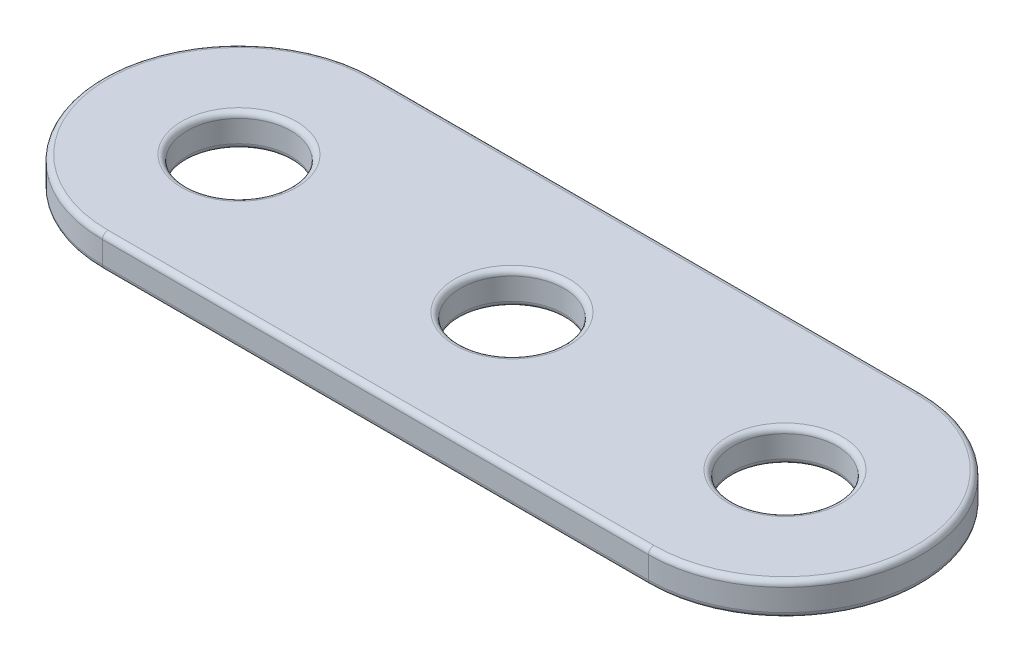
ISO-10303-21;
HEADER;
FILE_DESCRIPTION(('STEP AP214'),'2;1');
FILE_NAME('part.step','',(''),(''),'','','');
FILE_SCHEMA(('AUTOMOTIVE_DESIGN { 1 0 10303 214 1 1 1 1 }'));
ENDSEC;
DATA;
#1=APPLICATION_CONTEXT('core data for automotive mechanical design processes');
#2=APPLICATION_PROTOCOL_DEFINITION('international standard','automotive_design',2000,#1);
#3=PRODUCT_CONTEXT('',#1,'mechanical');
#4=PRODUCT('Part','Part','',(#3));
#5=PRODUCT_RELATED_PRODUCT_CATEGORY('part','',(#4));
#6=PRODUCT_DEFINITION_FORMATION('','',#4);
#7=PRODUCT_DEFINITION_CONTEXT('part definition',#1,'design');
#8=PRODUCT_DEFINITION('design','',#6,#7);
#9=PRODUCT_DEFINITION_SHAPE('','',#8);
#10=(LENGTH_UNIT() NAMED_UNIT(*) SI_UNIT(.MILLI.,.METRE.));
#11=(NAMED_UNIT(*) PLANE_ANGLE_UNIT() SI_UNIT($,.RADIAN.));
#12=(NAMED_UNIT(*) SI_UNIT($,.STERADIAN.) SOLID_ANGLE_UNIT());
#13=UNCERTAINTY_MEASURE_WITH_UNIT(LENGTH_MEASURE(1.E-05),#10,'distance_accuracy_value','');
#14=(GEOMETRIC_REPRESENTATION_CONTEXT(3) GLOBAL_UNCERTAINTY_ASSIGNED_CONTEXT((#13)) GLOBAL_UNIT_ASSIGNED_CONTEXT((#10,
#11,#12)) REPRESENTATION_CONTEXT('',''));
#15=CARTESIAN_POINT('',(0.,0.,0.));
#16=DIRECTION('',(0.,0.,1.));
#17=DIRECTION('',(1.,0.,0.));
#18=AXIS2_PLACEMENT_3D('',#15,#16,#17);
#19=CARTESIAN_POINT('',(0.,1.524,-6.35));
#20=DIRECTION('',(0.,-1.,0.));
#21=DIRECTION('',(0.,0.,-1.));
#22=AXIS2_PLACEMENT_3D('',#19,#20,#21);
#23=CYLINDRICAL_SURFACE('',#22,6.35);
#24=DIRECTION('',(0.,-1.,0.));
#25=VECTOR('',#24,1.);
#26=CARTESIAN_POINT('',(0.,1.524,-12.7));
#27=LINE('',#26,#25);
#28=CARTESIAN_POINT('',(0.,1.27,-12.7));
#29=VERTEX_POINT('',#28);
#30=CARTESIAN_POINT('',(0.,0.254000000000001,-12.7));
#31=VERTEX_POINT('',#30);
#32=EDGE_CURVE('E136',#29,#31,#27,.T.);
#33=ORIENTED_EDGE('',*,*,#32,.T.);
#34=CARTESIAN_POINT('',(0.,0.254,-6.35));
#35=DIRECTION('',(0.,1.,0.));
#36=DIRECTION('',(0.,0.,1.));
#37=AXIS2_PLACEMENT_3D('',#34,#35,#36);
#38=CIRCLE('',#37,6.35);
#39=CARTESIAN_POINT('',(0.,0.254000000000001,0.));
#40=VERTEX_POINT('',#39);
#41=EDGE_CURVE('E166',#31,#40,#38,.T.);
#42=ORIENTED_EDGE('',*,*,#41,.T.);
#43=DIRECTION('',(0.,-1.,0.));
#44=VECTOR('',#43,1.);
#45=CARTESIAN_POINT('',(0.,1.524,0.));
#46=LINE('',#45,#44);
#47=CARTESIAN_POINT('',(0.,1.27,0.));
#48=VERTEX_POINT('',#47);
#49=EDGE_CURVE('E110',#48,#40,#46,.T.);
#50=ORIENTED_EDGE('',*,*,#49,.F.);
#51=CARTESIAN_POINT('',(0.,1.27,-6.35));
#52=DIRECTION('',(0.,1.,0.));
#53=DIRECTION('',(0.,0.,1.));
#54=AXIS2_PLACEMENT_3D('',#51,#52,#53);
#55=CIRCLE('',#54,6.35);
#56=EDGE_CURVE('E164',#48,#29,#55,.F.);
#57=ORIENTED_EDGE('',*,*,#56,.T.);
#58=EDGE_LOOP('',(#33,#42,#50,#57));
#59=FACE_BOUND('',#58,.T.);
#60=ADVANCED_FACE('F26',(#59),#23,.T.);
#61=CARTESIAN_POINT('',(0.,1.524,0.));
#62=DIRECTION('',(0.,0.,-1.));
#63=DIRECTION('',(-1.,0.,0.));
#64=AXIS2_PLACEMENT_3D('',#61,#62,#63);
#65=PLANE('',#64);
#66=ORIENTED_EDGE('',*,*,#49,.T.);
#67=DIRECTION('',(1.,0.,0.));
#68=VECTOR('',#67,1.);
#69=CARTESIAN_POINT('',(0.,0.254,0.));
#70=LINE('',#69,#68);
#71=CARTESIAN_POINT('',(25.4,0.254000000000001,0.));
#72=VERTEX_POINT('',#71);
#73=EDGE_CURVE('E109',#40,#72,#70,.T.);
#74=ORIENTED_EDGE('',*,*,#73,.T.);
#75=DIRECTION('',(0.,-1.,0.));
#76=VECTOR('',#75,1.);
#77=CARTESIAN_POINT('',(25.4,1.524,0.));
#78=LINE('',#77,#76);
#79=CARTESIAN_POINT('',(25.4,1.27,0.));
#80=VERTEX_POINT('',#79);
#81=EDGE_CURVE('E92',#80,#72,#78,.T.);
#82=ORIENTED_EDGE('',*,*,#81,.F.);
#83=DIRECTION('',(1.,0.,0.));
#84=VECTOR('',#83,1.);
#85=CARTESIAN_POINT('',(0.,1.27,0.));
#86=LINE('',#85,#84);
#87=EDGE_CURVE('E106',#80,#48,#86,.F.);
#88=ORIENTED_EDGE('',*,*,#87,.T.);
#89=EDGE_LOOP('',(#66,#74,#82,#88));
#90=FACE_BOUND('',#89,.T.);
#91=ADVANCED_FACE('F105',(#90),#65,.F.);
#92=CARTESIAN_POINT('',(25.4,1.524,-6.35));
#93=DIRECTION('',(0.,-1.,0.));
#94=DIRECTION('',(0.,0.,-1.));
#95=AXIS2_PLACEMENT_3D('',#92,#93,#94);
#96=CYLINDRICAL_SURFACE('',#95,6.35);
#97=ORIENTED_EDGE('',*,*,#81,.T.);
#98=CARTESIAN_POINT('',(25.4,0.254,-6.35));
#99=DIRECTION('',(0.,1.,0.));
#100=DIRECTION('',(0.,0.,1.));
#101=AXIS2_PLACEMENT_3D('',#98,#99,#100);
#102=CIRCLE('',#101,6.35);
#103=CARTESIAN_POINT('',(25.4,0.254000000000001,-12.7));
#104=VERTEX_POINT('',#103);
#105=EDGE_CURVE('E98',#72,#104,#102,.T.);
#106=ORIENTED_EDGE('',*,*,#105,.T.);
#107=DIRECTION('',(0.,-1.,0.));
#108=VECTOR('',#107,1.);
#109=CARTESIAN_POINT('',(25.4,1.524,-12.7));
#110=LINE('',#109,#108);
#111=CARTESIAN_POINT('',(25.4,1.27,-12.7));
#112=VERTEX_POINT('',#111);
#113=EDGE_CURVE('E94',#112,#104,#110,.T.);
#114=ORIENTED_EDGE('',*,*,#113,.F.);
#115=CARTESIAN_POINT('',(25.4,1.27,-6.35));
#116=DIRECTION('',(0.,1.,0.));
#117=DIRECTION('',(0.,0.,1.));
#118=AXIS2_PLACEMENT_3D('',#115,#116,#117);
#119=CIRCLE('',#118,6.35);
#120=EDGE_CURVE('E89',#112,#80,#119,.F.);
#121=ORIENTED_EDGE('',*,*,#120,.T.);
#122=EDGE_LOOP('',(#97,#106,#114,#121));
#123=FACE_BOUND('',#122,.T.);
#124=ADVANCED_FACE('F91',(#123),#96,.T.);
#125=CARTESIAN_POINT('',(0.,1.524,-12.7));
#126=DIRECTION('',(0.,0.,1.));
#127=DIRECTION('',(1.,0.,0.));
#128=AXIS2_PLACEMENT_3D('',#125,#126,#127);
#129=PLANE('',#128);
#130=ORIENTED_EDGE('',*,*,#113,.T.);
#131=DIRECTION('',(-1.,0.,0.));
#132=VECTOR('',#131,1.);
#133=CARTESIAN_POINT('',(0.,0.254,-12.7));
#134=LINE('',#133,#132);
#135=EDGE_CURVE('E162',#104,#31,#134,.T.);
#136=ORIENTED_EDGE('',*,*,#135,.T.);
#137=ORIENTED_EDGE('',*,*,#32,.F.);
#138=DIRECTION('',(-1.,0.,0.));
#139=VECTOR('',#138,1.);
#140=CARTESIAN_POINT('',(25.4,1.27,-12.7));
#141=LINE('',#140,#139);
#142=EDGE_CURVE('E160',#29,#112,#141,.F.);
#143=ORIENTED_EDGE('',*,*,#142,.T.);
#144=EDGE_LOOP('',(#130,#136,#137,#143));
#145=FACE_BOUND('',#144,.T.);
#146=ADVANCED_FACE('F210',(#145),#129,.F.);
#147=CARTESIAN_POINT('',(0.,1.524,-6.35));
#148=DIRECTION('',(0.,1.,0.));
#149=DIRECTION('',(0.,0.,1.));
#150=AXIS2_PLACEMENT_3D('',#147,#148,#149);
#151=PLANE('',#150);
#152=CARTESIAN_POINT('',(25.4,1.524,-6.35));
#153=DIRECTION('',(0.,1.,0.));
#154=DIRECTION('',(0.,0.,1.));
#155=AXIS2_PLACEMENT_3D('',#152,#153,#154);
#156=CIRCLE('',#155,6.096);
#157=CARTESIAN_POINT('',(25.4,1.524,-0.254));
#158=VERTEX_POINT('',#157);
#159=CARTESIAN_POINT('',(25.4,1.524,-12.446));
#160=VERTEX_POINT('',#159);
#161=EDGE_CURVE('E33',#158,#160,#156,.T.);
#162=ORIENTED_EDGE('',*,*,#161,.T.);
#163=DIRECTION('',(-1.,0.,0.));
#164=VECTOR('',#163,1.);
#165=CARTESIAN_POINT('',(0.,1.524,-12.446));
#166=LINE('',#165,#164);
#167=CARTESIAN_POINT('',(0.,1.524,-12.446));
#168=VERTEX_POINT('',#167);
#169=EDGE_CURVE('E11',#160,#168,#166,.T.);
#170=ORIENTED_EDGE('',*,*,#169,.T.);
#171=CARTESIAN_POINT('',(0.,1.524,-6.35));
#172=DIRECTION('',(0.,1.,0.));
#173=DIRECTION('',(0.,0.,1.));
#174=AXIS2_PLACEMENT_3D('',#171,#172,#173);
#175=CIRCLE('',#174,6.096);
#176=CARTESIAN_POINT('',(0.,1.524,-0.254));
#177=VERTEX_POINT('',#176);
#178=EDGE_CURVE('E195',#168,#177,#175,.T.);
#179=ORIENTED_EDGE('',*,*,#178,.T.);
#180=DIRECTION('',(1.,0.,0.));
#181=VECTOR('',#180,1.);
#182=CARTESIAN_POINT('',(25.4,1.524,-0.254));
#183=LINE('',#182,#181);
#184=EDGE_CURVE('E43',#177,#158,#183,.T.);
#185=ORIENTED_EDGE('',*,*,#184,.T.);
#186=EDGE_LOOP('',(#162,#170,#179,#185));
#187=FACE_BOUND('',#186,.T.);
#188=CARTESIAN_POINT('',(0.,1.524,-6.35));
#189=DIRECTION('',(0.,1.,0.));
#190=DIRECTION('',(0.,0.,1.));
#191=AXIS2_PLACEMENT_3D('',#188,#189,#190);
#192=CIRCLE('',#191,2.667);
#193=CARTESIAN_POINT('',(0.,1.524,-3.683));
#194=VERTEX_POINT('',#193);
#195=EDGE_CURVE('E192',#194,#194,#192,.F.);
#196=ORIENTED_EDGE('',*,*,#195,.T.);
#197=EDGE_LOOP('',(#196));
#198=FACE_BOUND('',#197,.T.);
#199=CARTESIAN_POINT('',(12.7,1.524,-6.35));
#200=DIRECTION('',(0.,1.,0.));
#201=DIRECTION('',(0.,0.,1.));
#202=AXIS2_PLACEMENT_3D('',#199,#200,#201);
#203=CIRCLE('',#202,2.667);
#204=CARTESIAN_POINT('',(12.7,1.524,-3.683));
#205=VERTEX_POINT('',#204);
#206=EDGE_CURVE('E189',#205,#205,#203,.F.);
#207=ORIENTED_EDGE('',*,*,#206,.T.);
#208=EDGE_LOOP('',(#207));
#209=FACE_BOUND('',#208,.T.);
#210=CARTESIAN_POINT('',(25.4,1.524,-6.35));
#211=DIRECTION('',(0.,1.,0.));
#212=DIRECTION('',(0.,0.,1.));
#213=AXIS2_PLACEMENT_3D('',#210,#211,#212);
#214=CIRCLE('',#213,2.667);
#215=CARTESIAN_POINT('',(25.4,1.524,-3.683));
#216=VERTEX_POINT('',#215);
#217=EDGE_CURVE('E186',#216,#216,#214,.F.);
#218=ORIENTED_EDGE('',*,*,#217,.T.);
#219=EDGE_LOOP('',(#218));
#220=FACE_BOUND('',#219,.T.);
#221=ADVANCED_FACE('F198',(#187,#198,#209,#220),#151,.T.);
#222=CARTESIAN_POINT('',(0.,0.,-6.35));
#223=DIRECTION('',(0.,1.,0.));
#224=DIRECTION('',(0.,0.,1.));
#225=AXIS2_PLACEMENT_3D('',#222,#223,#224);
#226=PLANE('',#225);
#227=CARTESIAN_POINT('',(25.4,0.,-6.35));
#228=DIRECTION('',(0.,1.,0.));
#229=DIRECTION('',(0.,0.,1.));
#230=AXIS2_PLACEMENT_3D('',#227,#228,#229);
#231=CIRCLE('',#230,6.096);
#232=CARTESIAN_POINT('',(25.4,0.,-12.446));
#233=VERTEX_POINT('',#232);
#234=CARTESIAN_POINT('',(25.4,0.,-0.254));
#235=VERTEX_POINT('',#234);
#236=EDGE_CURVE('E155',#233,#235,#231,.F.);
#237=ORIENTED_EDGE('',*,*,#236,.T.);
#238=DIRECTION('',(1.,0.,0.));
#239=VECTOR('',#238,1.);
#240=CARTESIAN_POINT('',(0.,0.,-0.254));
#241=LINE('',#240,#239);
#242=CARTESIAN_POINT('',(0.,0.,-0.254));
#243=VERTEX_POINT('',#242);
#244=EDGE_CURVE('E99',#235,#243,#241,.F.);
#245=ORIENTED_EDGE('',*,*,#244,.T.);
#246=CARTESIAN_POINT('',(0.,0.,-6.35));
#247=DIRECTION('',(0.,1.,0.));
#248=DIRECTION('',(0.,0.,1.));
#249=AXIS2_PLACEMENT_3D('',#246,#247,#248);
#250=CIRCLE('',#249,6.096);
#251=CARTESIAN_POINT('',(0.,0.,-12.446));
#252=VERTEX_POINT('',#251);
#253=EDGE_CURVE('E151',#243,#252,#250,.F.);
#254=ORIENTED_EDGE('',*,*,#253,.T.);
#255=DIRECTION('',(-1.,0.,0.));
#256=VECTOR('',#255,1.);
#257=CARTESIAN_POINT('',(0.,0.,-12.446));
#258=LINE('',#257,#256);
#259=EDGE_CURVE('E153',#252,#233,#258,.F.);
#260=ORIENTED_EDGE('',*,*,#259,.T.);
#261=EDGE_LOOP('',(#237,#245,#254,#260));
#262=FACE_BOUND('',#261,.T.);
#263=CARTESIAN_POINT('',(0.,0.,-6.35));
#264=DIRECTION('',(0.,1.,0.));
#265=DIRECTION('',(0.,0.,1.));
#266=AXIS2_PLACEMENT_3D('',#263,#264,#265);
#267=CIRCLE('',#266,2.667);
#268=CARTESIAN_POINT('',(0.,0.,-3.683));
#269=VERTEX_POINT('',#268);
#270=EDGE_CURVE('E148',#269,#269,#267,.T.);
#271=ORIENTED_EDGE('',*,*,#270,.T.);
#272=EDGE_LOOP('',(#271));
#273=FACE_BOUND('',#272,.T.);
#274=CARTESIAN_POINT('',(12.7,0.,-6.35));
#275=DIRECTION('',(0.,1.,0.));
#276=DIRECTION('',(0.,0.,1.));
#277=AXIS2_PLACEMENT_3D('',#274,#275,#276);
#278=CIRCLE('',#277,2.667);
#279=CARTESIAN_POINT('',(12.7,0.,-3.683));
#280=VERTEX_POINT('',#279);
#281=EDGE_CURVE('E145',#280,#280,#278,.T.);
#282=ORIENTED_EDGE('',*,*,#281,.T.);
#283=EDGE_LOOP('',(#282));
#284=FACE_BOUND('',#283,.T.);
#285=CARTESIAN_POINT('',(25.4,0.,-6.35));
#286=DIRECTION('',(0.,1.,0.));
#287=DIRECTION('',(0.,0.,1.));
#288=AXIS2_PLACEMENT_3D('',#285,#286,#287);
#289=CIRCLE('',#288,2.667);
#290=CARTESIAN_POINT('',(25.4,0.,-3.683));
#291=VERTEX_POINT('',#290);
#292=EDGE_CURVE('E142',#291,#291,#289,.T.);
#293=ORIENTED_EDGE('',*,*,#292,.T.);
#294=EDGE_LOOP('',(#293));
#295=FACE_BOUND('',#294,.T.);
#296=ADVANCED_FACE('F239',(#262,#273,#284,#295),#226,.F.);
#297=CARTESIAN_POINT('',(0.,0.,-6.35));
#298=DIRECTION('',(0.,1.,0.));
#299=DIRECTION('',(0.,0.,1.));
#300=AXIS2_PLACEMENT_3D('',#297,#298,#299);
#301=CYLINDRICAL_SURFACE('',#300,2.413);
#302=CARTESIAN_POINT('',(0.,0.254,-6.35));
#303=DIRECTION('',(0.,1.,0.));
#304=DIRECTION('',(0.,0.,1.));
#305=AXIS2_PLACEMENT_3D('',#302,#303,#304);
#306=CIRCLE('',#305,2.413);
#307=CARTESIAN_POINT('',(0.,0.254,-3.937));
#308=VERTEX_POINT('',#307);
#309=EDGE_CURVE('E171',#308,#308,#306,.F.);
#310=CARTESIAN_POINT('',(0.,1.27,-6.35));
#311=DIRECTION('',(0.,1.,0.));
#312=DIRECTION('',(0.,0.,1.));
#313=AXIS2_PLACEMENT_3D('',#310,#311,#312);
#314=CIRCLE('',#313,2.413);
#315=CARTESIAN_POINT('',(0.,1.27,-3.937));
#316=VERTEX_POINT('',#315);
#317=EDGE_CURVE('E168',#316,#316,#314,.T.);
#318=CARTESIAN_POINT('',(0.,0.254,-3.937));
#319=CARTESIAN_POINT('',(0.,0.264583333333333,-3.937));
#320=CARTESIAN_POINT('',(0.,0.275166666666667,-3.937));
#321=CARTESIAN_POINT('',(0.,0.296333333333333,-3.937));
#322=CARTESIAN_POINT('',(0.,0.306916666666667,-3.937));
#323=CARTESIAN_POINT('',(0.,0.328083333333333,-3.937));
#324=CARTESIAN_POINT('',(0.,0.338666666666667,-3.937));
#325=CARTESIAN_POINT('',(0.,0.359833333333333,-3.937));
#326=CARTESIAN_POINT('',(0.,0.370416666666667,-3.937));
#327=CARTESIAN_POINT('',(0.,0.391583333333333,-3.937));
#328=CARTESIAN_POINT('',(0.,0.402166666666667,-3.937));
#329=CARTESIAN_POINT('',(0.,0.423333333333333,-3.937));
#330=CARTESIAN_POINT('',(0.,0.433916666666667,-3.937));
#331=CARTESIAN_POINT('',(0.,0.455083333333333,-3.937));
#332=CARTESIAN_POINT('',(0.,0.465666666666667,-3.937));
#333=CARTESIAN_POINT('',(0.,0.486833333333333,-3.937));
#334=CARTESIAN_POINT('',(0.,0.497416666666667,-3.937));
#335=CARTESIAN_POINT('',(0.,0.518583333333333,-3.937));
#336=CARTESIAN_POINT('',(0.,0.529166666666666,-3.937));
#337=CARTESIAN_POINT('',(0.,0.550333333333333,-3.937));
#338=CARTESIAN_POINT('',(0.,0.560916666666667,-3.937));
#339=CARTESIAN_POINT('',(0.,0.582083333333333,-3.937));
#340=CARTESIAN_POINT('',(0.,0.592666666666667,-3.937));
#341=CARTESIAN_POINT('',(0.,0.613833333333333,-3.937));
#342=CARTESIAN_POINT('',(0.,0.624416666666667,-3.937));
#343=CARTESIAN_POINT('',(0.,0.645583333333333,-3.937));
#344=CARTESIAN_POINT('',(0.,0.656166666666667,-3.937));
#345=CARTESIAN_POINT('',(0.,0.677333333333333,-3.937));
#346=CARTESIAN_POINT('',(0.,0.687916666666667,-3.937));
#347=CARTESIAN_POINT('',(0.,0.709083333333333,-3.937));
#348=CARTESIAN_POINT('',(0.,0.719666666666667,-3.937));
#349=CARTESIAN_POINT('',(0.,0.740833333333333,-3.937));
#350=CARTESIAN_POINT('',(0.,0.751416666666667,-3.937));
#351=CARTESIAN_POINT('',(0.,0.772583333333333,-3.937));
#352=CARTESIAN_POINT('',(0.,0.783166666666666,-3.937));
#353=CARTESIAN_POINT('',(0.,0.804333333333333,-3.937));
#354=CARTESIAN_POINT('',(0.,0.814916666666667,-3.937));
#355=CARTESIAN_POINT('',(0.,0.836083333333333,-3.937));
#356=CARTESIAN_POINT('',(0.,0.846666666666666,-3.937));
#357=CARTESIAN_POINT('',(0.,0.867833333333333,-3.937));
#358=CARTESIAN_POINT('',(0.,0.878416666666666,-3.937));
#359=CARTESIAN_POINT('',(0.,0.899583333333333,-3.937));
#360=CARTESIAN_POINT('',(0.,0.910166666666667,-3.937));
#361=CARTESIAN_POINT('',(0.,0.931333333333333,-3.937));
#362=CARTESIAN_POINT('',(0.,0.941916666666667,-3.937));
#363=CARTESIAN_POINT('',(0.,0.963083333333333,-3.937));
#364=CARTESIAN_POINT('',(0.,0.973666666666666,-3.937));
#365=CARTESIAN_POINT('',(0.,0.994833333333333,-3.937));
#366=CARTESIAN_POINT('',(0.,1.00541666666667,-3.937));
#367=CARTESIAN_POINT('',(0.,1.02658333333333,-3.937));
#368=CARTESIAN_POINT('',(0.,1.03716666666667,-3.937));
#369=CARTESIAN_POINT('',(0.,1.05833333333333,-3.937));
#370=CARTESIAN_POINT('',(0.,1.06891666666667,-3.937));
#371=CARTESIAN_POINT('',(0.,1.09008333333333,-3.937));
#372=CARTESIAN_POINT('',(0.,1.10066666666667,-3.937));
#373=CARTESIAN_POINT('',(0.,1.12183333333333,-3.937));
#374=CARTESIAN_POINT('',(0.,1.13241666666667,-3.937));
#375=CARTESIAN_POINT('',(0.,1.15358333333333,-3.937));
#376=CARTESIAN_POINT('',(0.,1.16416666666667,-3.937));
#377=CARTESIAN_POINT('',(0.,1.18533333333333,-3.937));
#378=CARTESIAN_POINT('',(0.,1.19591666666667,-3.937));
#379=CARTESIAN_POINT('',(0.,1.21708333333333,-3.937));
#380=CARTESIAN_POINT('',(0.,1.22766666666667,-3.937));
#381=CARTESIAN_POINT('',(0.,1.24883333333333,-3.937));
#382=CARTESIAN_POINT('',(0.,1.25941666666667,-3.937));
#383=CARTESIAN_POINT('',(0.,1.27,-3.937));
#384=B_SPLINE_CURVE_WITH_KNOTS('',3,(#318,#319,#320,#321,#322,#323,#324,#325,#326,#327,#328,
#329,#330,#331,#332,#333,#334,#335,#336,#337,#338,#339,#340,#341,#342,#343,#344,#345,#346,#347,
#348,#349,#350,#351,#352,#353,#354,#355,#356,#357,#358,#359,#360,#361,#362,#363,#364,#365,#366,
#367,#368,#369,#370,#371,#372,#373,#374,#375,#376,#377,#378,#379,#380,#381,#382,#383),
.UNSPECIFIED.,.F.,.F.,(4,2,2,2,2,2,2,2,2,2,2,2,2,2,2,2,2,2,2,2,2,2,2,2,2,2,2,2,2,2,2,2,4),(0.,
0.03175,0.0635,0.09525,0.127,0.15875,0.1905,0.22225,0.254,0.28575,0.3175,0.34925,0.381,0.41275,
0.4445,0.47625,0.508,0.53975,0.5715,0.60325,0.635,0.66675,0.6985,0.73025,0.762,0.79375,0.8255,
0.85725,0.889,0.92075,0.9525,0.98425,1.016),.UNSPECIFIED.);
#385=EDGE_CURVE('BSEAM242',#308,#316,#384,.T.);
#386=ORIENTED_EDGE('',*,*,#309,.T.);
#387=ORIENTED_EDGE('',*,*,#317,.T.);
#388=ORIENTED_EDGE('',*,*,#385,.T.);
#389=ORIENTED_EDGE('',*,*,#385,.F.);
#390=EDGE_LOOP('',(#386,#388,#387,#389));
#391=FACE_BOUND('',#390,.T.);
#392=ADVANCED_FACE('F242',(#391),#301,.F.);
#393=CARTESIAN_POINT('',(12.7,0.,-6.35));
#394=DIRECTION('',(0.,1.,0.));
#395=DIRECTION('',(0.,0.,1.));
#396=AXIS2_PLACEMENT_3D('',#393,#394,#395);
#397=CYLINDRICAL_SURFACE('',#396,2.413);
#398=CARTESIAN_POINT('',(12.7,0.254,-6.35));
#399=DIRECTION('',(0.,1.,0.));
#400=DIRECTION('',(0.,0.,1.));
#401=AXIS2_PLACEMENT_3D('',#398,#399,#400);
#402=CIRCLE('',#401,2.413);
#403=CARTESIAN_POINT('',(12.7,0.254,-3.937));
#404=VERTEX_POINT('',#403);
#405=EDGE_CURVE('E177',#404,#404,#402,.F.);
#406=CARTESIAN_POINT('',(12.7,1.27,-6.35));
#407=DIRECTION('',(0.,1.,0.));
#408=DIRECTION('',(0.,0.,1.));
#409=AXIS2_PLACEMENT_3D('',#406,#407,#408);
#410=CIRCLE('',#409,2.413);
#411=CARTESIAN_POINT('',(12.7,1.27,-3.937));
#412=VERTEX_POINT('',#411);
#413=EDGE_CURVE('E174',#412,#412,#410,.T.);
#414=CARTESIAN_POINT('',(12.7,0.254,-3.937));
#415=CARTESIAN_POINT('',(12.7,0.264583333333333,-3.937));
#416=CARTESIAN_POINT('',(12.7,0.275166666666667,-3.937));
#417=CARTESIAN_POINT('',(12.7,0.296333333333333,-3.937));
#418=CARTESIAN_POINT('',(12.7,0.306916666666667,-3.937));
#419=CARTESIAN_POINT('',(12.7,0.328083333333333,-3.937));
#420=CARTESIAN_POINT('',(12.7,0.338666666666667,-3.937));
#421=CARTESIAN_POINT('',(12.7,0.359833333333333,-3.937));
#422=CARTESIAN_POINT('',(12.7,0.370416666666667,-3.937));
#423=CARTESIAN_POINT('',(12.7,0.391583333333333,-3.937));
#424=CARTESIAN_POINT('',(12.7,0.402166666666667,-3.937));
#425=CARTESIAN_POINT('',(12.7,0.423333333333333,-3.937));
#426=CARTESIAN_POINT('',(12.7,0.433916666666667,-3.937));
#427=CARTESIAN_POINT('',(12.7,0.455083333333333,-3.937));
#428=CARTESIAN_POINT('',(12.7,0.465666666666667,-3.937));
#429=CARTESIAN_POINT('',(12.7,0.486833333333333,-3.937));
#430=CARTESIAN_POINT('',(12.7,0.497416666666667,-3.937));
#431=CARTESIAN_POINT('',(12.7,0.518583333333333,-3.937));
#432=CARTESIAN_POINT('',(12.7,0.529166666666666,-3.937));
#433=CARTESIAN_POINT('',(12.7,0.550333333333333,-3.937));
#434=CARTESIAN_POINT('',(12.7,0.560916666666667,-3.937));
#435=CARTESIAN_POINT('',(12.7,0.582083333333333,-3.937));
#436=CARTESIAN_POINT('',(12.7,0.592666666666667,-3.937));
#437=CARTESIAN_POINT('',(12.7,0.613833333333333,-3.937));
#438=CARTESIAN_POINT('',(12.7,0.624416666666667,-3.937));
#439=CARTESIAN_POINT('',(12.7,0.645583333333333,-3.937));
#440=CARTESIAN_POINT('',(12.7,0.656166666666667,-3.937));
#441=CARTESIAN_POINT('',(12.7,0.677333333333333,-3.937));
#442=CARTESIAN_POINT('',(12.7,0.687916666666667,-3.937));
#443=CARTESIAN_POINT('',(12.7,0.709083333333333,-3.937));
#444=CARTESIAN_POINT('',(12.7,0.719666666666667,-3.937));
#445=CARTESIAN_POINT('',(12.7,0.740833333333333,-3.937));
#446=CARTESIAN_POINT('',(12.7,0.751416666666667,-3.937));
#447=CARTESIAN_POINT('',(12.7,0.772583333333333,-3.937));
#448=CARTESIAN_POINT('',(12.7,0.783166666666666,-3.937));
#449=CARTESIAN_POINT('',(12.7,0.804333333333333,-3.937));
#450=CARTESIAN_POINT('',(12.7,0.814916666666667,-3.937));
#451=CARTESIAN_POINT('',(12.7,0.836083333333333,-3.937));
#452=CARTESIAN_POINT('',(12.7,0.846666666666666,-3.937));
#453=CARTESIAN_POINT('',(12.7,0.867833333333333,-3.937));
#454=CARTESIAN_POINT('',(12.7,0.878416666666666,-3.937));
#455=CARTESIAN_POINT('',(12.7,0.899583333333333,-3.937));
#456=CARTESIAN_POINT('',(12.7,0.910166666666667,-3.937));
#457=CARTESIAN_POINT('',(12.7,0.931333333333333,-3.937));
#458=CARTESIAN_POINT('',(12.7,0.941916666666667,-3.937));
#459=CARTESIAN_POINT('',(12.7,0.963083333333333,-3.937));
#460=CARTESIAN_POINT('',(12.7,0.973666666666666,-3.937));
#461=CARTESIAN_POINT('',(12.7,0.994833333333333,-3.937));
#462=CARTESIAN_POINT('',(12.7,1.00541666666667,-3.937));
#463=CARTESIAN_POINT('',(12.7,1.02658333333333,-3.937));
#464=CARTESIAN_POINT('',(12.7,1.03716666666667,-3.937));
#465=CARTESIAN_POINT('',(12.7,1.05833333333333,-3.937));
#466=CARTESIAN_POINT('',(12.7,1.06891666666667,-3.937));
#467=CARTESIAN_POINT('',(12.7,1.09008333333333,-3.937));
#468=CARTESIAN_POINT('',(12.7,1.10066666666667,-3.937));
#469=CARTESIAN_POINT('',(12.7,1.12183333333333,-3.937));
#470=CARTESIAN_POINT('',(12.7,1.13241666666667,-3.937));
#471=CARTESIAN_POINT('',(12.7,1.15358333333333,-3.937));
#472=CARTESIAN_POINT('',(12.7,1.16416666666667,-3.937));
#473=CARTESIAN_POINT('',(12.7,1.18533333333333,-3.937));
#474=CARTESIAN_POINT('',(12.7,1.19591666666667,-3.937));
#475=CARTESIAN_POINT('',(12.7,1.21708333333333,-3.937));
#476=CARTESIAN_POINT('',(12.7,1.22766666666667,-3.937));
#477=CARTESIAN_POINT('',(12.7,1.24883333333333,-3.937));
#478=CARTESIAN_POINT('',(12.7,1.25941666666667,-3.937));
#479=CARTESIAN_POINT('',(12.7,1.27,-3.937));
#480=B_SPLINE_CURVE_WITH_KNOTS('',3,(#414,#415,#416,#417,#418,#419,#420,#421,#422,#423,#424,
#425,#426,#427,#428,#429,#430,#431,#432,#433,#434,#435,#436,#437,#438,#439,#440,#441,#442,#443,
#444,#445,#446,#447,#448,#449,#450,#451,#452,#453,#454,#455,#456,#457,#458,#459,#460,#461,#462,
#463,#464,#465,#466,#467,#468,#469,#470,#471,#472,#473,#474,#475,#476,#477,#478,#479),
.UNSPECIFIED.,.F.,.F.,(4,2,2,2,2,2,2,2,2,2,2,2,2,2,2,2,2,2,2,2,2,2,2,2,2,2,2,2,2,2,2,2,4),(0.,
0.03175,0.0635,0.09525,0.127,0.15875,0.1905,0.22225,0.254,0.28575,0.3175,0.34925,0.381,0.41275,
0.4445,0.47625,0.508,0.53975,0.5715,0.60325,0.635,0.66675,0.6985,0.73025,0.762,0.79375,0.8255,
0.85725,0.889,0.92075,0.9525,0.98425,1.016),.UNSPECIFIED.);
#481=EDGE_CURVE('BSEAM246',#404,#412,#480,.T.);
#482=ORIENTED_EDGE('',*,*,#405,.T.);
#483=ORIENTED_EDGE('',*,*,#413,.T.);
#484=ORIENTED_EDGE('',*,*,#481,.T.);
#485=ORIENTED_EDGE('',*,*,#481,.F.);
#486=EDGE_LOOP('',(#482,#484,#483,#485));
#487=FACE_BOUND('',#486,.T.);
#488=ADVANCED_FACE('F246',(#487),#397,.F.);
#489=CARTESIAN_POINT('',(25.4,0.,-6.35));
#490=DIRECTION('',(0.,1.,0.));
#491=DIRECTION('',(0.,0.,1.));
#492=AXIS2_PLACEMENT_3D('',#489,#490,#491);
#493=CYLINDRICAL_SURFACE('',#492,2.413);
#494=CARTESIAN_POINT('',(25.4,0.254,-6.35));
#495=DIRECTION('',(0.,1.,0.));
#496=DIRECTION('',(0.,0.,1.));
#497=AXIS2_PLACEMENT_3D('',#494,#495,#496);
#498=CIRCLE('',#497,2.413);
#499=CARTESIAN_POINT('',(25.4,0.254,-3.937));
#500=VERTEX_POINT('',#499);
#501=EDGE_CURVE('E183',#500,#500,#498,.F.);
#502=CARTESIAN_POINT('',(25.4,1.27,-6.35));
#503=DIRECTION('',(0.,1.,0.));
#504=DIRECTION('',(0.,0.,1.));
#505=AXIS2_PLACEMENT_3D('',#502,#503,#504);
#506=CIRCLE('',#505,2.413);
#507=CARTESIAN_POINT('',(25.4,1.27,-3.937));
#508=VERTEX_POINT('',#507);
#509=EDGE_CURVE('E180',#508,#508,#506,.T.);
#510=CARTESIAN_POINT('',(25.4,0.254,-3.937));
#511=CARTESIAN_POINT('',(25.4,0.264583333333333,-3.937));
#512=CARTESIAN_POINT('',(25.4,0.275166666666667,-3.937));
#513=CARTESIAN_POINT('',(25.4,0.296333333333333,-3.937));
#514=CARTESIAN_POINT('',(25.4,0.306916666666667,-3.937));
#515=CARTESIAN_POINT('',(25.4,0.328083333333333,-3.937));
#516=CARTESIAN_POINT('',(25.4,0.338666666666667,-3.937));
#517=CARTESIAN_POINT('',(25.4,0.359833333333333,-3.937));
#518=CARTESIAN_POINT('',(25.4,0.370416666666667,-3.937));
#519=CARTESIAN_POINT('',(25.4,0.391583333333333,-3.937));
#520=CARTESIAN_POINT('',(25.4,0.402166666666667,-3.937));
#521=CARTESIAN_POINT('',(25.4,0.423333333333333,-3.937));
#522=CARTESIAN_POINT('',(25.4,0.433916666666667,-3.937));
#523=CARTESIAN_POINT('',(25.4,0.455083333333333,-3.937));
#524=CARTESIAN_POINT('',(25.4,0.465666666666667,-3.937));
#525=CARTESIAN_POINT('',(25.4,0.486833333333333,-3.937));
#526=CARTESIAN_POINT('',(25.4,0.497416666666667,-3.937));
#527=CARTESIAN_POINT('',(25.4,0.518583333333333,-3.937));
#528=CARTESIAN_POINT('',(25.4,0.529166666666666,-3.937));
#529=CARTESIAN_POINT('',(25.4,0.550333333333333,-3.937));
#530=CARTESIAN_POINT('',(25.4,0.560916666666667,-3.937));
#531=CARTESIAN_POINT('',(25.4,0.582083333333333,-3.937));
#532=CARTESIAN_POINT('',(25.4,0.592666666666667,-3.937));
#533=CARTESIAN_POINT('',(25.4,0.613833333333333,-3.937));
#534=CARTESIAN_POINT('',(25.4,0.624416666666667,-3.937));
#535=CARTESIAN_POINT('',(25.4,0.645583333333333,-3.937));
#536=CARTESIAN_POINT('',(25.4,0.656166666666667,-3.937));
#537=CARTESIAN_POINT('',(25.4,0.677333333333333,-3.937));
#538=CARTESIAN_POINT('',(25.4,0.687916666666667,-3.937));
#539=CARTESIAN_POINT('',(25.4,0.709083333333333,-3.937));
#540=CARTESIAN_POINT('',(25.4,0.719666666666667,-3.937));
#541=CARTESIAN_POINT('',(25.4,0.740833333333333,-3.937));
#542=CARTESIAN_POINT('',(25.4,0.751416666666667,-3.937));
#543=CARTESIAN_POINT('',(25.4,0.772583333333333,-3.937));
#544=CARTESIAN_POINT('',(25.4,0.783166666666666,-3.937));
#545=CARTESIAN_POINT('',(25.4,0.804333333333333,-3.937));
#546=CARTESIAN_POINT('',(25.4,0.814916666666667,-3.937));
#547=CARTESIAN_POINT('',(25.4,0.836083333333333,-3.937));
#548=CARTESIAN_POINT('',(25.4,0.846666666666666,-3.937));
#549=CARTESIAN_POINT('',(25.4,0.867833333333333,-3.937));
#550=CARTESIAN_POINT('',(25.4,0.878416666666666,-3.937));
#551=CARTESIAN_POINT('',(25.4,0.899583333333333,-3.937));
#552=CARTESIAN_POINT('',(25.4,0.910166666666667,-3.937));
#553=CARTESIAN_POINT('',(25.4,0.931333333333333,-3.937));
#554=CARTESIAN_POINT('',(25.4,0.941916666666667,-3.937));
#555=CARTESIAN_POINT('',(25.4,0.963083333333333,-3.937));
#556=CARTESIAN_POINT('',(25.4,0.973666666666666,-3.937));
#557=CARTESIAN_POINT('',(25.4,0.994833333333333,-3.937));
#558=CARTESIAN_POINT('',(25.4,1.00541666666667,-3.937));
#559=CARTESIAN_POINT('',(25.4,1.02658333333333,-3.937));
#560=CARTESIAN_POINT('',(25.4,1.03716666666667,-3.937));
#561=CARTESIAN_POINT('',(25.4,1.05833333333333,-3.937));
#562=CARTESIAN_POINT('',(25.4,1.06891666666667,-3.937));
#563=CARTESIAN_POINT('',(25.4,1.09008333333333,-3.937));
#564=CARTESIAN_POINT('',(25.4,1.10066666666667,-3.937));
#565=CARTESIAN_POINT('',(25.4,1.12183333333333,-3.937));
#566=CARTESIAN_POINT('',(25.4,1.13241666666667,-3.937));
#567=CARTESIAN_POINT('',(25.4,1.15358333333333,-3.937));
#568=CARTESIAN_POINT('',(25.4,1.16416666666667,-3.937));
#569=CARTESIAN_POINT('',(25.4,1.18533333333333,-3.937));
#570=CARTESIAN_POINT('',(25.4,1.19591666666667,-3.937));
#571=CARTESIAN_POINT('',(25.4,1.21708333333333,-3.937));
#572=CARTESIAN_POINT('',(25.4,1.22766666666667,-3.937));
#573=CARTESIAN_POINT('',(25.4,1.24883333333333,-3.937));
#574=CARTESIAN_POINT('',(25.4,1.25941666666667,-3.937));
#575=CARTESIAN_POINT('',(25.4,1.27,-3.937));
#576=B_SPLINE_CURVE_WITH_KNOTS('',3,(#510,#511,#512,#513,#514,#515,#516,#517,#518,#519,#520,
#521,#522,#523,#524,#525,#526,#527,#528,#529,#530,#531,#532,#533,#534,#535,#536,#537,#538,#539,
#540,#541,#542,#543,#544,#545,#546,#547,#548,#549,#550,#551,#552,#553,#554,#555,#556,#557,#558,
#559,#560,#561,#562,#563,#564,#565,#566,#567,#568,#569,#570,#571,#572,#573,#574,#575),
.UNSPECIFIED.,.F.,.F.,(4,2,2,2,2,2,2,2,2,2,2,2,2,2,2,2,2,2,2,2,2,2,2,2,2,2,2,2,2,2,2,2,4),(0.,
0.03175,0.0635,0.09525,0.127,0.15875,0.1905,0.22225,0.254,0.28575,0.3175,0.34925,0.381,0.41275,
0.4445,0.47625,0.508,0.53975,0.5715,0.60325,0.635,0.66675,0.6985,0.73025,0.762,0.79375,0.8255,
0.85725,0.889,0.92075,0.9525,0.98425,1.016),.UNSPECIFIED.);
#577=EDGE_CURVE('BSEAM250',#500,#508,#576,.T.);
#578=ORIENTED_EDGE('',*,*,#501,.T.);
#579=ORIENTED_EDGE('',*,*,#509,.T.);
#580=ORIENTED_EDGE('',*,*,#577,.T.);
#581=ORIENTED_EDGE('',*,*,#577,.F.);
#582=EDGE_LOOP('',(#578,#580,#579,#581));
#583=FACE_BOUND('',#582,.T.);
#584=ADVANCED_FACE('F250',(#583),#493,.F.);
#585=CARTESIAN_POINT('',(0.,0.254,-12.446));
#586=DIRECTION('',(-1.,0.,0.));
#587=DIRECTION('',(0.,0.,1.));
#588=AXIS2_PLACEMENT_3D('',#585,#586,#587);
#589=CYLINDRICAL_SURFACE('',#588,0.254);
#590=CARTESIAN_POINT('',(25.4,0.254,-12.446));
#591=DIRECTION('',(1.,0.,0.));
#592=DIRECTION('',(0.,0.,-1.));
#593=AXIS2_PLACEMENT_3D('',#590,#591,#592);
#594=CIRCLE('',#593,0.254);
#595=EDGE_CURVE('E130',#233,#104,#594,.T.);
#596=ORIENTED_EDGE('',*,*,#595,.F.);
#597=ORIENTED_EDGE('',*,*,#259,.F.);
#598=CARTESIAN_POINT('',(0.,0.254,-12.446));
#599=DIRECTION('',(-1.,0.,0.));
#600=DIRECTION('',(0.,0.,1.));
#601=AXIS2_PLACEMENT_3D('',#598,#599,#600);
#602=CIRCLE('',#601,0.254);
#603=EDGE_CURVE('E133',#31,#252,#602,.T.);
#604=ORIENTED_EDGE('',*,*,#603,.F.);
#605=ORIENTED_EDGE('',*,*,#135,.F.);
#606=EDGE_LOOP('',(#596,#597,#604,#605));
#607=FACE_BOUND('',#606,.T.);
#608=ADVANCED_FACE('F254',(#607),#589,.T.);
#609=CARTESIAN_POINT('',(0.,0.254,-6.35));
#610=DIRECTION('',(0.,1.,0.));
#611=DIRECTION('',(0.,0.,1.));
#612=AXIS2_PLACEMENT_3D('',#609,#610,#611);
#613=TOROIDAL_SURFACE('',#612,6.096,0.254);
#614=ORIENTED_EDGE('',*,*,#603,.T.);
#615=ORIENTED_EDGE('',*,*,#253,.F.);
#616=CARTESIAN_POINT('',(0.,0.254,-0.254));
#617=DIRECTION('',(1.,0.,0.));
#618=DIRECTION('',(0.,0.,-1.));
#619=AXIS2_PLACEMENT_3D('',#616,#617,#618);
#620=CIRCLE('',#619,0.254);
#621=EDGE_CURVE('E123',#40,#243,#620,.T.);
#622=ORIENTED_EDGE('',*,*,#621,.F.);
#623=ORIENTED_EDGE('',*,*,#41,.F.);
#624=EDGE_LOOP('',(#614,#615,#622,#623));
#625=FACE_BOUND('',#624,.T.);
#626=ADVANCED_FACE('F258',(#625),#613,.T.);
#627=CARTESIAN_POINT('',(25.4,0.254,-6.35));
#628=DIRECTION('',(0.,1.,0.));
#629=DIRECTION('',(0.,0.,1.));
#630=AXIS2_PLACEMENT_3D('',#627,#628,#629);
#631=TOROIDAL_SURFACE('',#630,6.096,0.254);
#632=ORIENTED_EDGE('',*,*,#595,.T.);
#633=ORIENTED_EDGE('',*,*,#105,.F.);
#634=CARTESIAN_POINT('',(25.4,0.254,-0.254));
#635=DIRECTION('',(-1.,0.,0.));
#636=DIRECTION('',(0.,0.,1.));
#637=AXIS2_PLACEMENT_3D('',#634,#635,#636);
#638=CIRCLE('',#637,0.254);
#639=EDGE_CURVE('E121',#235,#72,#638,.T.);
#640=ORIENTED_EDGE('',*,*,#639,.F.);
#641=ORIENTED_EDGE('',*,*,#236,.F.);
#642=EDGE_LOOP('',(#632,#633,#640,#641));
#643=FACE_BOUND('',#642,.T.);
#644=ADVANCED_FACE('F262',(#643),#631,.T.);
#645=CARTESIAN_POINT('',(0.,0.254,-0.254));
#646=DIRECTION('',(1.,0.,0.));
#647=DIRECTION('',(0.,0.,-1.));
#648=AXIS2_PLACEMENT_3D('',#645,#646,#647);
#649=CYLINDRICAL_SURFACE('',#648,0.254);
#650=ORIENTED_EDGE('',*,*,#621,.T.);
#651=ORIENTED_EDGE('',*,*,#244,.F.);
#652=ORIENTED_EDGE('',*,*,#639,.T.);
#653=ORIENTED_EDGE('',*,*,#73,.F.);
#654=EDGE_LOOP('',(#650,#651,#652,#653));
#655=FACE_BOUND('',#654,.T.);
#656=ADVANCED_FACE('F266',(#655),#649,.T.);
#657=CARTESIAN_POINT('',(0.,0.254,-6.35));
#658=DIRECTION('',(0.,1.,0.));
#659=DIRECTION('',(0.,0.,1.));
#660=AXIS2_PLACEMENT_3D('',#657,#658,#659);
#661=TOROIDAL_SURFACE('',#660,2.667,0.254);
#662=ORIENTED_EDGE('',*,*,#309,.F.);
#663=EDGE_LOOP('',(#662));
#664=FACE_BOUND('',#663,.T.);
#665=ORIENTED_EDGE('',*,*,#270,.F.);
#666=EDGE_LOOP('',(#665));
#667=FACE_BOUND('',#666,.T.);
#668=ADVANCED_FACE('F270',(#664,#667),#661,.T.);
#669=CARTESIAN_POINT('',(12.7,0.254,-6.35));
#670=DIRECTION('',(0.,1.,0.));
#671=DIRECTION('',(0.,0.,1.));
#672=AXIS2_PLACEMENT_3D('',#669,#670,#671);
#673=TOROIDAL_SURFACE('',#672,2.667,0.254);
#674=ORIENTED_EDGE('',*,*,#405,.F.);
#675=EDGE_LOOP('',(#674));
#676=FACE_BOUND('',#675,.T.);
#677=ORIENTED_EDGE('',*,*,#281,.F.);
#678=EDGE_LOOP('',(#677));
#679=FACE_BOUND('',#678,.T.);
#680=ADVANCED_FACE('F274',(#676,#679),#673,.T.);
#681=CARTESIAN_POINT('',(25.4,0.254,-6.35));
#682=DIRECTION('',(0.,1.,0.));
#683=DIRECTION('',(0.,0.,1.));
#684=AXIS2_PLACEMENT_3D('',#681,#682,#683);
#685=TOROIDAL_SURFACE('',#684,2.667,0.254);
#686=ORIENTED_EDGE('',*,*,#501,.F.);
#687=EDGE_LOOP('',(#686));
#688=FACE_BOUND('',#687,.T.);
#689=ORIENTED_EDGE('',*,*,#292,.F.);
#690=EDGE_LOOP('',(#689));
#691=FACE_BOUND('',#690,.T.);
#692=ADVANCED_FACE('F278',(#688,#691),#685,.T.);
#693=CARTESIAN_POINT('',(0.,1.27,-0.254));
#694=DIRECTION('',(-1.,0.,0.));
#695=DIRECTION('',(0.,0.,1.));
#696=AXIS2_PLACEMENT_3D('',#693,#694,#695);
#697=CYLINDRICAL_SURFACE('',#696,0.254);
#698=CARTESIAN_POINT('',(0.,1.27,-0.254));
#699=DIRECTION('',(-1.,0.,0.));
#700=DIRECTION('',(0.,0.,1.));
#701=AXIS2_PLACEMENT_3D('',#698,#699,#700);
#702=CIRCLE('',#701,0.254);
#703=EDGE_CURVE('E117',#48,#177,#702,.T.);
#704=ORIENTED_EDGE('',*,*,#703,.F.);
#705=ORIENTED_EDGE('',*,*,#87,.F.);
#706=CARTESIAN_POINT('',(25.4,1.27,-0.254));
#707=DIRECTION('',(1.,0.,0.));
#708=DIRECTION('',(0.,0.,-1.));
#709=AXIS2_PLACEMENT_3D('',#706,#707,#708);
#710=CIRCLE('',#709,0.254);
#711=EDGE_CURVE('E115',#158,#80,#710,.T.);
#712=ORIENTED_EDGE('',*,*,#711,.F.);
#713=ORIENTED_EDGE('',*,*,#184,.F.);
#714=EDGE_LOOP('',(#704,#705,#712,#713));
#715=FACE_BOUND('',#714,.T.);
#716=ADVANCED_FACE('F114',(#715),#697,.T.);
#717=CARTESIAN_POINT('',(25.4,1.27,-6.35));
#718=DIRECTION('',(0.,1.,0.));
#719=DIRECTION('',(0.,0.,1.));
#720=AXIS2_PLACEMENT_3D('',#717,#718,#719);
#721=TOROIDAL_SURFACE('',#720,6.096,0.254);
#722=ORIENTED_EDGE('',*,*,#711,.T.);
#723=ORIENTED_EDGE('',*,*,#120,.F.);
#724=CARTESIAN_POINT('',(25.4,1.27,-12.446));
#725=DIRECTION('',(-1.,0.,0.));
#726=DIRECTION('',(0.,0.,1.));
#727=AXIS2_PLACEMENT_3D('',#724,#725,#726);
#728=CIRCLE('',#727,0.254);
#729=EDGE_CURVE('E125',#160,#112,#728,.T.);
#730=ORIENTED_EDGE('',*,*,#729,.F.);
#731=ORIENTED_EDGE('',*,*,#161,.F.);
#732=EDGE_LOOP('',(#722,#723,#730,#731));
#733=FACE_BOUND('',#732,.T.);
#734=ADVANCED_FACE('F120',(#733),#721,.T.);
#735=CARTESIAN_POINT('',(0.,1.27,-6.35));
#736=DIRECTION('',(0.,1.,0.));
#737=DIRECTION('',(0.,0.,1.));
#738=AXIS2_PLACEMENT_3D('',#735,#736,#737);
#739=TOROIDAL_SURFACE('',#738,6.096,0.254);
#740=ORIENTED_EDGE('',*,*,#703,.T.);
#741=ORIENTED_EDGE('',*,*,#178,.F.);
#742=CARTESIAN_POINT('',(0.,1.27,-12.446));
#743=DIRECTION('',(1.,0.,0.));
#744=DIRECTION('',(0.,0.,-1.));
#745=AXIS2_PLACEMENT_3D('',#742,#743,#744);
#746=CIRCLE('',#745,0.254);
#747=EDGE_CURVE('E204',#29,#168,#746,.T.);
#748=ORIENTED_EDGE('',*,*,#747,.F.);
#749=ORIENTED_EDGE('',*,*,#56,.F.);
#750=EDGE_LOOP('',(#740,#741,#748,#749));
#751=FACE_BOUND('',#750,.T.);
#752=ADVANCED_FACE('F203',(#751),#739,.T.);
#753=CARTESIAN_POINT('',(0.,1.27,-12.446));
#754=DIRECTION('',(1.,0.,0.));
#755=DIRECTION('',(0.,0.,-1.));
#756=AXIS2_PLACEMENT_3D('',#753,#754,#755);
#757=CYLINDRICAL_SURFACE('',#756,0.254);
#758=ORIENTED_EDGE('',*,*,#729,.T.);
#759=ORIENTED_EDGE('',*,*,#142,.F.);
#760=ORIENTED_EDGE('',*,*,#747,.T.);
#761=ORIENTED_EDGE('',*,*,#169,.F.);
#762=EDGE_LOOP('',(#758,#759,#760,#761));
#763=FACE_BOUND('',#762,.T.);
#764=ADVANCED_FACE('F213',(#763),#757,.T.);
#765=CARTESIAN_POINT('',(0.,1.27,-6.35));
#766=DIRECTION('',(0.,1.,0.));
#767=DIRECTION('',(0.,0.,1.));
#768=AXIS2_PLACEMENT_3D('',#765,#766,#767);
#769=TOROIDAL_SURFACE('',#768,2.667,0.254);
#770=ORIENTED_EDGE('',*,*,#195,.F.);
#771=EDGE_LOOP('',(#770));
#772=FACE_BOUND('',#771,.T.);
#773=ORIENTED_EDGE('',*,*,#317,.F.);
#774=EDGE_LOOP('',(#773));
#775=FACE_BOUND('',#774,.T.);
#776=ADVANCED_FACE('F216',(#772,#775),#769,.T.);
#777=CARTESIAN_POINT('',(12.7,1.27,-6.35));
#778=DIRECTION('',(0.,1.,0.));
#779=DIRECTION('',(0.,0.,1.));
#780=AXIS2_PLACEMENT_3D('',#777,#778,#779);
#781=TOROIDAL_SURFACE('',#780,2.667,0.254);
#782=ORIENTED_EDGE('',*,*,#206,.F.);
#783=EDGE_LOOP('',(#782));
#784=FACE_BOUND('',#783,.T.);
#785=ORIENTED_EDGE('',*,*,#413,.F.);
#786=EDGE_LOOP('',(#785));
#787=FACE_BOUND('',#786,.T.);
#788=ADVANCED_FACE('F222',(#784,#787),#781,.T.);
#789=CARTESIAN_POINT('',(25.4,1.27,-6.35));
#790=DIRECTION('',(0.,1.,0.));
#791=DIRECTION('',(0.,0.,1.));
#792=AXIS2_PLACEMENT_3D('',#789,#790,#791);
#793=TOROIDAL_SURFACE('',#792,2.667,0.254);
#794=ORIENTED_EDGE('',*,*,#217,.F.);
#795=EDGE_LOOP('',(#794));
#796=FACE_BOUND('',#795,.T.);
#797=ORIENTED_EDGE('',*,*,#509,.F.);
#798=EDGE_LOOP('',(#797));
#799=FACE_BOUND('',#798,.T.);
#800=ADVANCED_FACE('F307',(#796,#799),#793,.T.);
#801=CLOSED_SHELL('',(#60,#91,#124,#146,#221,#296,#392,#488,#584,#608,#626,#644,#656,#668,#680,
#692,#716,#734,#752,#764,#776,#788,#800));
#802=MANIFOLD_SOLID_BREP('B2',#801);
#803=ADVANCED_BREP_SHAPE_REPRESENTATION('',(#18,#802),#14);
#804=SHAPE_DEFINITION_REPRESENTATION(#9,#803);
ENDSEC;
END-ISO-10303-21;
